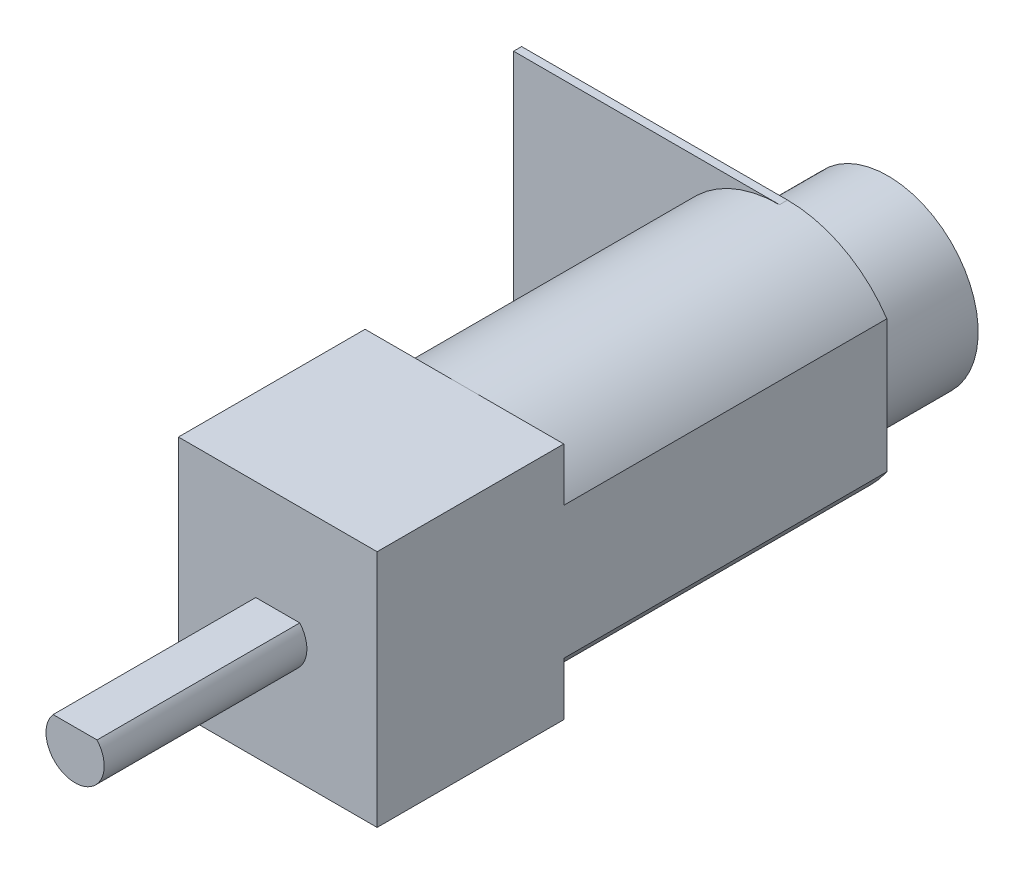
ISO-10303-21;
HEADER;
FILE_DESCRIPTION(('STEP AP214'),'2;1');
FILE_NAME('part.step','',(''),(''),'','','');
FILE_SCHEMA(('AUTOMOTIVE_DESIGN { 1 0 10303 214 1 1 1 1 }'));
ENDSEC;
DATA;
#1=APPLICATION_CONTEXT('core data for automotive mechanical design processes');
#2=APPLICATION_PROTOCOL_DEFINITION('international standard','automotive_design',2000,#1);
#3=PRODUCT_CONTEXT('',#1,'mechanical');
#4=PRODUCT('Part','Part','',(#3));
#5=PRODUCT_RELATED_PRODUCT_CATEGORY('part','',(#4));
#6=PRODUCT_DEFINITION_FORMATION('','',#4);
#7=PRODUCT_DEFINITION_CONTEXT('part definition',#1,'design');
#8=PRODUCT_DEFINITION('design','',#6,#7);
#9=PRODUCT_DEFINITION_SHAPE('','',#8);
#10=(LENGTH_UNIT() NAMED_UNIT(*) SI_UNIT(.MILLI.,.METRE.));
#11=(NAMED_UNIT(*) PLANE_ANGLE_UNIT() SI_UNIT($,.RADIAN.));
#12=(NAMED_UNIT(*) SI_UNIT($,.STERADIAN.) SOLID_ANGLE_UNIT());
#13=UNCERTAINTY_MEASURE_WITH_UNIT(LENGTH_MEASURE(1.E-05),#10,'distance_accuracy_value','');
#14=(GEOMETRIC_REPRESENTATION_CONTEXT(3) GLOBAL_UNCERTAINTY_ASSIGNED_CONTEXT((#13)) GLOBAL_UNIT_ASSIGNED_CONTEXT((#10,
#11,#12)) REPRESENTATION_CONTEXT('',''));
#15=CARTESIAN_POINT('',(0.,0.,0.));
#16=DIRECTION('',(0.,0.,1.));
#17=DIRECTION('',(1.,0.,0.));
#18=AXIS2_PLACEMENT_3D('',#15,#16,#17);
#19=CARTESIAN_POINT('',(0.,0.,9.3));
#20=DIRECTION('',(0.,0.,1.));
#21=DIRECTION('',(1.,0.,0.));
#22=AXIS2_PLACEMENT_3D('',#19,#20,#21);
#23=PLANE('',#22);
#24=DIRECTION('',(0.,-1.,0.));
#25=VECTOR('',#24,1.);
#26=CARTESIAN_POINT('',(-4.95,-5.95,9.3));
#27=LINE('',#26,#25);
#28=CARTESIAN_POINT('',(-4.95,5.95,9.3));
#29=VERTEX_POINT('',#28);
#30=CARTESIAN_POINT('',(-4.95,-5.95,9.3));
#31=VERTEX_POINT('',#30);
#32=EDGE_CURVE('E260',#29,#31,#27,.T.);
#33=ORIENTED_EDGE('',*,*,#32,.T.);
#34=DIRECTION('',(1.,0.,0.));
#35=VECTOR('',#34,1.);
#36=CARTESIAN_POINT('',(4.95,-5.95,9.3));
#37=LINE('',#36,#35);
#38=CARTESIAN_POINT('',(4.95,-5.95,9.3));
#39=VERTEX_POINT('',#38);
#40=EDGE_CURVE('E264',#31,#39,#37,.T.);
#41=ORIENTED_EDGE('',*,*,#40,.T.);
#42=DIRECTION('',(0.,1.,0.));
#43=VECTOR('',#42,1.);
#44=CARTESIAN_POINT('',(4.95,-5.95,9.3));
#45=LINE('',#44,#43);
#46=CARTESIAN_POINT('',(4.95,5.95,9.3));
#47=VERTEX_POINT('',#46);
#48=EDGE_CURVE('E268',#39,#47,#45,.T.);
#49=ORIENTED_EDGE('',*,*,#48,.T.);
#50=DIRECTION('',(-1.,0.,0.));
#51=VECTOR('',#50,1.);
#52=CARTESIAN_POINT('',(4.95,5.95,9.3));
#53=LINE('',#52,#51);
#54=EDGE_CURVE('E271',#47,#29,#53,.T.);
#55=ORIENTED_EDGE('',*,*,#54,.T.);
#56=EDGE_LOOP('',(#33,#41,#49,#55));
#57=FACE_BOUND('',#56,.T.);
#58=CARTESIAN_POINT('',(0.,0.,9.3));
#59=DIRECTION('',(0.,0.,1.));
#60=DIRECTION('',(1.,0.,0.));
#61=AXIS2_PLACEMENT_3D('',#58,#59,#60);
#62=CIRCLE('',#61,1.45);
#63=CARTESIAN_POINT('',(-1.09544511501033,0.95,9.3));
#64=VERTEX_POINT('',#63);
#65=CARTESIAN_POINT('',(1.09544511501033,0.95,9.3));
#66=VERTEX_POINT('',#65);
#67=EDGE_CURVE('E58',#64,#66,#62,.T.);
#68=ORIENTED_EDGE('',*,*,#67,.F.);
#69=DIRECTION('',(1.,0.,0.));
#70=VECTOR('',#69,1.);
#71=CARTESIAN_POINT('',(0.,0.95,9.3));
#72=LINE('',#71,#70);
#73=EDGE_CURVE('E159',#64,#66,#72,.T.);
#74=ORIENTED_EDGE('',*,*,#73,.T.);
#75=EDGE_LOOP('',(#68,#74));
#76=FACE_BOUND('',#75,.T.);
#77=ADVANCED_FACE('F41',(#57,#76),#23,.T.);
#78=CARTESIAN_POINT('',(0.,0.,0.));
#79=DIRECTION('',(0.,0.,1.));
#80=DIRECTION('',(1.,0.,0.));
#81=AXIS2_PLACEMENT_3D('',#78,#79,#80);
#82=PLANE('',#81);
#83=CARTESIAN_POINT('',(0.,0.,0.));
#84=DIRECTION('',(0.,0.,-1.));
#85=DIRECTION('',(-1.,0.,0.));
#86=AXIS2_PLACEMENT_3D('',#83,#84,#85);
#87=CIRCLE('',#86,5.95);
#88=CARTESIAN_POINT('',(4.95,-3.30151480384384,0.));
#89=VERTEX_POINT('',#88);
#90=CARTESIAN_POINT('',(0.,-5.95,0.));
#91=VERTEX_POINT('',#90);
#92=EDGE_CURVE('E237',#89,#91,#87,.T.);
#93=ORIENTED_EDGE('',*,*,#92,.F.);
#94=DIRECTION('',(0.,1.,0.));
#95=VECTOR('',#94,1.);
#96=CARTESIAN_POINT('',(4.95,-5.95,0.));
#97=LINE('',#96,#95);
#98=CARTESIAN_POINT('',(4.95,-5.95,0.));
#99=VERTEX_POINT('',#98);
#100=EDGE_CURVE('E285',#99,#89,#97,.T.);
#101=ORIENTED_EDGE('',*,*,#100,.F.);
#102=DIRECTION('',(1.,0.,0.));
#103=VECTOR('',#102,1.);
#104=CARTESIAN_POINT('',(4.95,-5.95,0.));
#105=LINE('',#104,#103);
#106=EDGE_CURVE('E279',#91,#99,#105,.T.);
#107=ORIENTED_EDGE('',*,*,#106,.F.);
#108=EDGE_LOOP('',(#93,#101,#107));
#109=FACE_BOUND('',#108,.T.);
#110=ADVANCED_FACE('F322',(#109),#82,.F.);
#111=CARTESIAN_POINT('',(-4.95,-3.30151480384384,0.));
#112=VERTEX_POINT('',#111);
#113=EDGE_CURVE('E51',#91,#112,#87,.T.);
#114=ORIENTED_EDGE('',*,*,#113,.F.);
#115=CARTESIAN_POINT('',(-4.95,-5.95,0.));
#116=VERTEX_POINT('',#115);
#117=EDGE_CURVE('E280',#116,#91,#105,.T.);
#118=ORIENTED_EDGE('',*,*,#117,.F.);
#119=DIRECTION('',(0.,-1.,0.));
#120=VECTOR('',#119,1.);
#121=CARTESIAN_POINT('',(-4.95,-5.95,0.));
#122=LINE('',#121,#120);
#123=EDGE_CURVE('E259',#112,#116,#122,.T.);
#124=ORIENTED_EDGE('',*,*,#123,.F.);
#125=EDGE_LOOP('',(#114,#118,#124));
#126=FACE_BOUND('',#125,.T.);
#127=ADVANCED_FACE('F368',(#126),#82,.F.);
#128=CARTESIAN_POINT('',(-4.95,3.30151480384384,0.));
#129=VERTEX_POINT('',#128);
#130=CARTESIAN_POINT('',(0.,5.95,0.));
#131=VERTEX_POINT('',#130);
#132=EDGE_CURVE('E231',#129,#131,#87,.T.);
#133=ORIENTED_EDGE('',*,*,#132,.F.);
#134=CARTESIAN_POINT('',(-4.95,5.95,0.));
#135=VERTEX_POINT('',#134);
#136=EDGE_CURVE('E275',#135,#129,#122,.T.);
#137=ORIENTED_EDGE('',*,*,#136,.F.);
#138=DIRECTION('',(-1.,0.,0.));
#139=VECTOR('',#138,1.);
#140=CARTESIAN_POINT('',(4.95,5.95,0.));
#141=LINE('',#140,#139);
#142=EDGE_CURVE('E289',#131,#135,#141,.T.);
#143=ORIENTED_EDGE('',*,*,#142,.F.);
#144=EDGE_LOOP('',(#133,#137,#143));
#145=FACE_BOUND('',#144,.T.);
#146=ADVANCED_FACE('F354',(#145),#82,.F.);
#147=CARTESIAN_POINT('',(-4.95,-5.95,9.3));
#148=DIRECTION('',(1.,0.,0.));
#149=DIRECTION('',(0.,0.,-1.));
#150=AXIS2_PLACEMENT_3D('',#147,#148,#149);
#151=PLANE('',#150);
#152=ORIENTED_EDGE('',*,*,#136,.T.);
#153=DIRECTION('',(0.,0.,1.));
#154=VECTOR('',#153,1.);
#155=CARTESIAN_POINT('',(-4.95,3.30151480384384,-15.7));
#156=LINE('',#155,#154);
#157=CARTESIAN_POINT('',(-4.95,3.30151480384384,-15.7));
#158=VERTEX_POINT('',#157);
#159=EDGE_CURVE('E255',#158,#129,#156,.T.);
#160=ORIENTED_EDGE('',*,*,#159,.F.);
#161=DIRECTION('',(0.,1.,0.));
#162=VECTOR('',#161,1.);
#163=CARTESIAN_POINT('',(-4.95,0.,-15.7));
#164=LINE('',#163,#162);
#165=CARTESIAN_POINT('',(-4.95,-3.30151480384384,-15.7));
#166=VERTEX_POINT('',#165);
#167=EDGE_CURVE('E232',#166,#158,#164,.T.);
#168=ORIENTED_EDGE('',*,*,#167,.F.);
#169=DIRECTION('',(0.,0.,1.));
#170=VECTOR('',#169,1.);
#171=CARTESIAN_POINT('',(-4.95,-3.30151480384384,-15.7));
#172=LINE('',#171,#170);
#173=EDGE_CURVE('E243',#166,#112,#172,.T.);
#174=ORIENTED_EDGE('',*,*,#173,.T.);
#175=ORIENTED_EDGE('',*,*,#123,.T.);
#176=DIRECTION('',(0.,0.,-1.));
#177=VECTOR('',#176,1.);
#178=CARTESIAN_POINT('',(-4.95,-5.95,9.3));
#179=LINE('',#178,#177);
#180=EDGE_CURVE('E45',#31,#116,#179,.T.);
#181=ORIENTED_EDGE('',*,*,#180,.F.);
#182=ORIENTED_EDGE('',*,*,#32,.F.);
#183=DIRECTION('',(0.,0.,-1.));
#184=VECTOR('',#183,1.);
#185=CARTESIAN_POINT('',(-4.95,5.95,9.3));
#186=LINE('',#185,#184);
#187=EDGE_CURVE('E274',#29,#135,#186,.T.);
#188=ORIENTED_EDGE('',*,*,#187,.T.);
#189=EDGE_LOOP('',(#152,#160,#168,#174,#175,#181,#182,#188));
#190=FACE_BOUND('',#189,.T.);
#191=ADVANCED_FACE('F43',(#190),#151,.F.);
#192=CARTESIAN_POINT('',(4.95,-5.95,9.3));
#193=DIRECTION('',(0.,1.,0.));
#194=DIRECTION('',(-1.,0.,0.));
#195=AXIS2_PLACEMENT_3D('',#192,#193,#194);
#196=PLANE('',#195);
#197=ORIENTED_EDGE('',*,*,#117,.T.);
#198=ORIENTED_EDGE('',*,*,#106,.T.);
#199=DIRECTION('',(0.,0.,-1.));
#200=VECTOR('',#199,1.);
#201=CARTESIAN_POINT('',(4.95,-5.95,9.3));
#202=LINE('',#201,#200);
#203=EDGE_CURVE('E299',#39,#99,#202,.T.);
#204=ORIENTED_EDGE('',*,*,#203,.F.);
#205=ORIENTED_EDGE('',*,*,#40,.F.);
#206=ORIENTED_EDGE('',*,*,#180,.T.);
#207=EDGE_LOOP('',(#197,#198,#204,#205,#206));
#208=FACE_BOUND('',#207,.T.);
#209=ADVANCED_FACE('F365',(#208),#196,.F.);
#210=CARTESIAN_POINT('',(4.95,-5.95,9.3));
#211=DIRECTION('',(-1.,0.,0.));
#212=DIRECTION('',(0.,0.,1.));
#213=AXIS2_PLACEMENT_3D('',#210,#211,#212);
#214=PLANE('',#213);
#215=ORIENTED_EDGE('',*,*,#100,.T.);
#216=DIRECTION('',(0.,0.,1.));
#217=VECTOR('',#216,1.);
#218=CARTESIAN_POINT('',(4.95,-3.30151480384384,-15.7));
#219=LINE('',#218,#217);
#220=CARTESIAN_POINT('',(4.95,-3.30151480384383,-16.1));
#221=VERTEX_POINT('',#220);
#222=EDGE_CURVE('E247',#221,#89,#219,.T.);
#223=ORIENTED_EDGE('',*,*,#222,.F.);
#224=DIRECTION('',(0.,-1.,0.));
#225=VECTOR('',#224,1.);
#226=CARTESIAN_POINT('',(4.95,0.,-16.1));
#227=LINE('',#226,#225);
#228=CARTESIAN_POINT('',(4.95,3.30151480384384,-16.1));
#229=VERTEX_POINT('',#228);
#230=EDGE_CURVE('E204',#229,#221,#227,.T.);
#231=ORIENTED_EDGE('',*,*,#230,.F.);
#232=DIRECTION('',(0.,0.,1.));
#233=VECTOR('',#232,1.);
#234=CARTESIAN_POINT('',(4.95,3.30151480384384,-15.7));
#235=LINE('',#234,#233);
#236=CARTESIAN_POINT('',(4.95,3.30151480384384,0.));
#237=VERTEX_POINT('',#236);
#238=EDGE_CURVE('E251',#229,#237,#235,.T.);
#239=ORIENTED_EDGE('',*,*,#238,.T.);
#240=CARTESIAN_POINT('',(4.95,5.95,0.));
#241=VERTEX_POINT('',#240);
#242=EDGE_CURVE('E284',#237,#241,#97,.T.);
#243=ORIENTED_EDGE('',*,*,#242,.T.);
#244=DIRECTION('',(0.,0.,-1.));
#245=VECTOR('',#244,1.);
#246=CARTESIAN_POINT('',(4.95,5.95,9.3));
#247=LINE('',#246,#245);
#248=EDGE_CURVE('E296',#47,#241,#247,.T.);
#249=ORIENTED_EDGE('',*,*,#248,.F.);
#250=ORIENTED_EDGE('',*,*,#48,.F.);
#251=ORIENTED_EDGE('',*,*,#203,.T.);
#252=EDGE_LOOP('',(#215,#223,#231,#239,#243,#249,#250,#251));
#253=FACE_BOUND('',#252,.T.);
#254=ADVANCED_FACE('F323',(#253),#214,.F.);
#255=CARTESIAN_POINT('',(4.95,5.95,9.3));
#256=DIRECTION('',(0.,-1.,0.));
#257=DIRECTION('',(1.,0.,0.));
#258=AXIS2_PLACEMENT_3D('',#255,#256,#257);
#259=PLANE('',#258);
#260=EDGE_CURVE('E265',#241,#131,#141,.T.);
#261=ORIENTED_EDGE('',*,*,#260,.T.);
#262=ORIENTED_EDGE('',*,*,#142,.T.);
#263=ORIENTED_EDGE('',*,*,#187,.F.);
#264=ORIENTED_EDGE('',*,*,#54,.F.);
#265=ORIENTED_EDGE('',*,*,#248,.T.);
#266=EDGE_LOOP('',(#261,#262,#263,#264,#265));
#267=FACE_BOUND('',#266,.T.);
#268=ADVANCED_FACE('F348',(#267),#259,.F.);
#269=EDGE_CURVE('E308',#131,#237,#87,.T.);
#270=ORIENTED_EDGE('',*,*,#269,.F.);
#271=ORIENTED_EDGE('',*,*,#260,.F.);
#272=ORIENTED_EDGE('',*,*,#242,.F.);
#273=EDGE_LOOP('',(#270,#271,#272));
#274=FACE_BOUND('',#273,.T.);
#275=ADVANCED_FACE('F350',(#274),#82,.F.);
#276=CARTESIAN_POINT('',(0.,0.,-15.7));
#277=DIRECTION('',(0.,0.,1.));
#278=DIRECTION('',(1.,0.,0.));
#279=AXIS2_PLACEMENT_3D('',#276,#277,#278);
#280=CYLINDRICAL_SURFACE('',#279,5.95);
#281=ORIENTED_EDGE('',*,*,#132,.T.);
#282=ORIENTED_EDGE('',*,*,#269,.T.);
#283=ORIENTED_EDGE('',*,*,#238,.F.);
#284=CARTESIAN_POINT('',(0.,0.,-16.1));
#285=DIRECTION('',(0.,0.,-1.));
#286=DIRECTION('',(-1.,0.,0.));
#287=AXIS2_PLACEMENT_3D('',#284,#285,#286);
#288=CIRCLE('',#287,5.95);
#289=CARTESIAN_POINT('',(0.,5.95,-16.1));
#290=VERTEX_POINT('',#289);
#291=EDGE_CURVE('E200',#290,#229,#288,.T.);
#292=ORIENTED_EDGE('',*,*,#291,.F.);
#293=DIRECTION('',(0.,0.,1.));
#294=VECTOR('',#293,1.);
#295=CARTESIAN_POINT('',(0.,5.95,-16.1));
#296=LINE('',#295,#294);
#297=CARTESIAN_POINT('',(0.,5.95,-15.7));
#298=VERTEX_POINT('',#297);
#299=EDGE_CURVE('E208',#290,#298,#296,.T.);
#300=ORIENTED_EDGE('',*,*,#299,.T.);
#301=CARTESIAN_POINT('',(0.,0.,-15.7));
#302=DIRECTION('',(0.,0.,-1.));
#303=DIRECTION('',(-1.,0.,0.));
#304=AXIS2_PLACEMENT_3D('',#301,#302,#303);
#305=CIRCLE('',#304,5.95);
#306=EDGE_CURVE('E236',#158,#298,#305,.T.);
#307=ORIENTED_EDGE('',*,*,#306,.F.);
#308=ORIENTED_EDGE('',*,*,#159,.T.);
#309=EDGE_LOOP('',(#281,#282,#283,#292,#300,#307,#308));
#310=FACE_BOUND('',#309,.T.);
#311=ADVANCED_FACE('F341',(#310),#280,.T.);
#312=ORIENTED_EDGE('',*,*,#92,.T.);
#313=ORIENTED_EDGE('',*,*,#113,.T.);
#314=ORIENTED_EDGE('',*,*,#173,.F.);
#315=CARTESIAN_POINT('',(0.,-5.95,-15.7));
#316=VERTEX_POINT('',#315);
#317=EDGE_CURVE('E66',#316,#166,#305,.T.);
#318=ORIENTED_EDGE('',*,*,#317,.F.);
#319=DIRECTION('',(0.,0.,1.));
#320=VECTOR('',#319,1.);
#321=CARTESIAN_POINT('',(0.,-5.95,-16.1));
#322=LINE('',#321,#320);
#323=CARTESIAN_POINT('',(0.,-5.95,-16.1));
#324=VERTEX_POINT('',#323);
#325=EDGE_CURVE('E228',#324,#316,#322,.T.);
#326=ORIENTED_EDGE('',*,*,#325,.F.);
#327=CARTESIAN_POINT('',(0.,0.,-16.1));
#328=DIRECTION('',(0.,0.,-1.));
#329=DIRECTION('',(-1.,0.,0.));
#330=AXIS2_PLACEMENT_3D('',#327,#328,#329);
#331=CIRCLE('',#330,5.95);
#332=EDGE_CURVE('E185',#221,#324,#331,.T.);
#333=ORIENTED_EDGE('',*,*,#332,.F.);
#334=ORIENTED_EDGE('',*,*,#222,.T.);
#335=EDGE_LOOP('',(#312,#313,#314,#318,#326,#333,#334));
#336=FACE_BOUND('',#335,.T.);
#337=ADVANCED_FACE('F318',(#336),#280,.T.);
#338=CARTESIAN_POINT('',(0.,0.,-15.7));
#339=DIRECTION('',(0.,0.,-1.));
#340=DIRECTION('',(-1.,0.,0.));
#341=AXIS2_PLACEMENT_3D('',#338,#339,#340);
#342=PLANE('',#341);
#343=ORIENTED_EDGE('',*,*,#167,.T.);
#344=ORIENTED_EDGE('',*,*,#306,.T.);
#345=DIRECTION('',(1.,0.,0.));
#346=VECTOR('',#345,1.);
#347=CARTESIAN_POINT('',(0.,5.95,-15.7));
#348=LINE('',#347,#346);
#349=CARTESIAN_POINT('',(-13.25,5.95,-15.7));
#350=VERTEX_POINT('',#349);
#351=EDGE_CURVE('E189',#350,#298,#348,.T.);
#352=ORIENTED_EDGE('',*,*,#351,.F.);
#353=DIRECTION('',(0.,-1.,0.));
#354=VECTOR('',#353,1.);
#355=CARTESIAN_POINT('',(-13.25,0.,-15.7));
#356=LINE('',#355,#354);
#357=CARTESIAN_POINT('',(-13.25,-5.95,-15.7));
#358=VERTEX_POINT('',#357);
#359=EDGE_CURVE('E212',#350,#358,#356,.T.);
#360=ORIENTED_EDGE('',*,*,#359,.T.);
#361=DIRECTION('',(1.,0.,0.));
#362=VECTOR('',#361,1.);
#363=CARTESIAN_POINT('',(0.,-5.95,-15.7));
#364=LINE('',#363,#362);
#365=EDGE_CURVE('E183',#358,#316,#364,.T.);
#366=ORIENTED_EDGE('',*,*,#365,.T.);
#367=ORIENTED_EDGE('',*,*,#317,.T.);
#368=EDGE_LOOP('',(#343,#344,#352,#360,#366,#367));
#369=FACE_BOUND('',#368,.T.);
#370=ADVANCED_FACE('F360',(#369),#342,.F.);
#371=CARTESIAN_POINT('',(0.,-5.95,-16.1));
#372=DIRECTION('',(0.,-1.,0.));
#373=DIRECTION('',(1.,0.,0.));
#374=AXIS2_PLACEMENT_3D('',#371,#372,#373);
#375=PLANE('',#374);
#376=ORIENTED_EDGE('',*,*,#365,.F.);
#377=DIRECTION('',(0.,0.,1.));
#378=VECTOR('',#377,1.);
#379=CARTESIAN_POINT('',(-13.25,-5.95,-16.1));
#380=LINE('',#379,#378);
#381=CARTESIAN_POINT('',(-13.25,-5.95,-16.1));
#382=VERTEX_POINT('',#381);
#383=EDGE_CURVE('E225',#382,#358,#380,.T.);
#384=ORIENTED_EDGE('',*,*,#383,.F.);
#385=DIRECTION('',(1.,0.,0.));
#386=VECTOR('',#385,1.);
#387=CARTESIAN_POINT('',(0.,-5.95,-16.1));
#388=LINE('',#387,#386);
#389=EDGE_CURVE('E188',#382,#324,#388,.T.);
#390=ORIENTED_EDGE('',*,*,#389,.T.);
#391=ORIENTED_EDGE('',*,*,#325,.T.);
#392=EDGE_LOOP('',(#376,#384,#390,#391));
#393=FACE_BOUND('',#392,.T.);
#394=ADVANCED_FACE('F331',(#393),#375,.T.);
#395=CARTESIAN_POINT('',(-13.25,0.,-16.1));
#396=DIRECTION('',(-1.,0.,0.));
#397=DIRECTION('',(0.,-1.,0.));
#398=AXIS2_PLACEMENT_3D('',#395,#396,#397);
#399=PLANE('',#398);
#400=ORIENTED_EDGE('',*,*,#359,.F.);
#401=DIRECTION('',(0.,0.,1.));
#402=VECTOR('',#401,1.);
#403=CARTESIAN_POINT('',(-13.25,5.95,-16.1));
#404=LINE('',#403,#402);
#405=CARTESIAN_POINT('',(-13.25,5.95,-16.1));
#406=VERTEX_POINT('',#405);
#407=EDGE_CURVE('E222',#406,#350,#404,.T.);
#408=ORIENTED_EDGE('',*,*,#407,.F.);
#409=DIRECTION('',(0.,-1.,0.));
#410=VECTOR('',#409,1.);
#411=CARTESIAN_POINT('',(-13.25,0.,-16.1));
#412=LINE('',#411,#410);
#413=EDGE_CURVE('E193',#406,#382,#412,.T.);
#414=ORIENTED_EDGE('',*,*,#413,.T.);
#415=ORIENTED_EDGE('',*,*,#383,.T.);
#416=EDGE_LOOP('',(#400,#408,#414,#415));
#417=FACE_BOUND('',#416,.T.);
#418=ADVANCED_FACE('F335',(#417),#399,.T.);
#419=CARTESIAN_POINT('',(0.,5.95,-16.1));
#420=DIRECTION('',(0.,-1.,0.));
#421=DIRECTION('',(0.,0.,-1.));
#422=AXIS2_PLACEMENT_3D('',#419,#420,#421);
#423=PLANE('',#422);
#424=ORIENTED_EDGE('',*,*,#351,.T.);
#425=ORIENTED_EDGE('',*,*,#299,.F.);
#426=DIRECTION('',(1.,0.,0.));
#427=VECTOR('',#426,1.);
#428=CARTESIAN_POINT('',(0.,5.95,-16.1));
#429=LINE('',#428,#427);
#430=EDGE_CURVE('E197',#406,#290,#429,.T.);
#431=ORIENTED_EDGE('',*,*,#430,.F.);
#432=ORIENTED_EDGE('',*,*,#407,.T.);
#433=EDGE_LOOP('',(#424,#425,#431,#432));
#434=FACE_BOUND('',#433,.T.);
#435=ADVANCED_FACE('F340',(#434),#423,.F.);
#436=CARTESIAN_POINT('',(0.,0.,-16.1));
#437=DIRECTION('',(0.,0.,-1.));
#438=DIRECTION('',(-1.,0.,0.));
#439=AXIS2_PLACEMENT_3D('',#436,#437,#438);
#440=PLANE('',#439);
#441=CARTESIAN_POINT('',(0.,0.,-16.1));
#442=DIRECTION('',(0.,0.,-1.));
#443=DIRECTION('',(-1.,0.,0.));
#444=AXIS2_PLACEMENT_3D('',#441,#442,#443);
#445=CIRCLE('',#444,4.5);
#446=CARTESIAN_POINT('',(-4.5,0.,-16.1));
#447=VERTEX_POINT('',#446);
#448=EDGE_CURVE('E11',#447,#447,#445,.T.);
#449=ORIENTED_EDGE('',*,*,#448,.F.);
#450=EDGE_LOOP('',(#449));
#451=FACE_BOUND('',#450,.T.);
#452=ORIENTED_EDGE('',*,*,#332,.T.);
#453=ORIENTED_EDGE('',*,*,#389,.F.);
#454=ORIENTED_EDGE('',*,*,#413,.F.);
#455=ORIENTED_EDGE('',*,*,#430,.T.);
#456=ORIENTED_EDGE('',*,*,#291,.T.);
#457=ORIENTED_EDGE('',*,*,#230,.T.);
#458=EDGE_LOOP('',(#452,#453,#454,#455,#456,#457));
#459=FACE_BOUND('',#458,.T.);
#460=ADVANCED_FACE('F326',(#451,#459),#440,.T.);
#461=CARTESIAN_POINT('',(0.,0.,-21.1));
#462=DIRECTION('',(0.,0.,1.));
#463=DIRECTION('',(1.,0.,0.));
#464=AXIS2_PLACEMENT_3D('',#461,#462,#463);
#465=CYLINDRICAL_SURFACE('',#464,4.5);
#466=CARTESIAN_POINT('',(0.,0.,-21.1));
#467=DIRECTION('',(0.,0.,-1.));
#468=DIRECTION('',(-1.,0.,0.));
#469=AXIS2_PLACEMENT_3D('',#466,#467,#468);
#470=CIRCLE('',#469,4.5);
#471=CARTESIAN_POINT('',(-4.5,0.,-21.1));
#472=VERTEX_POINT('',#471);
#473=EDGE_CURVE('E162',#472,#472,#470,.T.);
#474=ORIENTED_EDGE('',*,*,#473,.F.);
#475=EDGE_LOOP('',(#474));
#476=FACE_BOUND('',#475,.T.);
#477=ORIENTED_EDGE('',*,*,#448,.T.);
#478=EDGE_LOOP('',(#477));
#479=FACE_BOUND('',#478,.T.);
#480=ADVANCED_FACE('F393',(#476,#479),#465,.T.);
#481=CARTESIAN_POINT('',(0.,0.,-21.1));
#482=DIRECTION('',(0.,0.,-1.));
#483=DIRECTION('',(-1.,0.,0.));
#484=AXIS2_PLACEMENT_3D('',#481,#482,#483);
#485=PLANE('',#484);
#486=ORIENTED_EDGE('',*,*,#473,.T.);
#487=EDGE_LOOP('',(#486));
#488=FACE_BOUND('',#487,.T.);
#489=ADVANCED_FACE('F397',(#488),#485,.T.);
#490=CARTESIAN_POINT('',(0.,0.95,19.4));
#491=DIRECTION('',(0.,1.,0.));
#492=DIRECTION('',(0.,0.,1.));
#493=AXIS2_PLACEMENT_3D('',#490,#491,#492);
#494=PLANE('',#493);
#495=ORIENTED_EDGE('',*,*,#73,.F.);
#496=DIRECTION('',(0.,0.,-1.));
#497=VECTOR('',#496,1.);
#498=CARTESIAN_POINT('',(-1.09544511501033,0.95,19.4));
#499=LINE('',#498,#497);
#500=CARTESIAN_POINT('',(-1.09544511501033,0.95,19.4));
#501=VERTEX_POINT('',#500);
#502=EDGE_CURVE('E153',#501,#64,#499,.T.);
#503=ORIENTED_EDGE('',*,*,#502,.F.);
#504=DIRECTION('',(1.,0.,0.));
#505=VECTOR('',#504,1.);
#506=CARTESIAN_POINT('',(0.,0.95,19.4));
#507=LINE('',#506,#505);
#508=CARTESIAN_POINT('',(1.09544511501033,0.95,19.4));
#509=VERTEX_POINT('',#508);
#510=EDGE_CURVE('E158',#501,#509,#507,.T.);
#511=ORIENTED_EDGE('',*,*,#510,.T.);
#512=DIRECTION('',(0.,0.,-1.));
#513=VECTOR('',#512,1.);
#514=CARTESIAN_POINT('',(1.09544511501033,0.95,19.4));
#515=LINE('',#514,#513);
#516=EDGE_CURVE('E163',#509,#66,#515,.T.);
#517=ORIENTED_EDGE('',*,*,#516,.T.);
#518=EDGE_LOOP('',(#495,#503,#511,#517));
#519=FACE_BOUND('',#518,.T.);
#520=ADVANCED_FACE('F155',(#519),#494,.T.);
#521=CARTESIAN_POINT('',(0.,0.,19.4));
#522=DIRECTION('',(0.,0.,-1.));
#523=DIRECTION('',(-1.,0.,0.));
#524=AXIS2_PLACEMENT_3D('',#521,#522,#523);
#525=CYLINDRICAL_SURFACE('',#524,1.45);
#526=ORIENTED_EDGE('',*,*,#67,.T.);
#527=ORIENTED_EDGE('',*,*,#516,.F.);
#528=CARTESIAN_POINT('',(0.,0.,19.4));
#529=DIRECTION('',(0.,0.,1.));
#530=DIRECTION('',(1.,0.,0.));
#531=AXIS2_PLACEMENT_3D('',#528,#529,#530);
#532=CIRCLE('',#531,1.45);
#533=EDGE_CURVE('E166',#501,#509,#532,.T.);
#534=ORIENTED_EDGE('',*,*,#533,.F.);
#535=ORIENTED_EDGE('',*,*,#502,.T.);
#536=EDGE_LOOP('',(#526,#527,#534,#535));
#537=FACE_BOUND('',#536,.T.);
#538=ADVANCED_FACE('F167',(#537),#525,.T.);
#539=CARTESIAN_POINT('',(0.,0.,19.4));
#540=DIRECTION('',(0.,0.,1.));
#541=DIRECTION('',(1.,0.,0.));
#542=AXIS2_PLACEMENT_3D('',#539,#540,#541);
#543=PLANE('',#542);
#544=ORIENTED_EDGE('',*,*,#510,.F.);
#545=ORIENTED_EDGE('',*,*,#533,.T.);
#546=EDGE_LOOP('',(#544,#545));
#547=FACE_BOUND('',#546,.T.);
#548=ADVANCED_FACE('F171',(#547),#543,.T.);
#549=CLOSED_SHELL('',(#77,#110,#127,#146,#191,#209,#254,#268,#275,#311,#337,#370,#394,#418,#435,
#460,#480,#489,#520,#538,#548));
#550=MANIFOLD_SOLID_BREP('B2',#549);
#551=ADVANCED_BREP_SHAPE_REPRESENTATION('',(#18,#550),#14);
#552=SHAPE_DEFINITION_REPRESENTATION(#9,#551);
ENDSEC;
END-ISO-10303-21;
